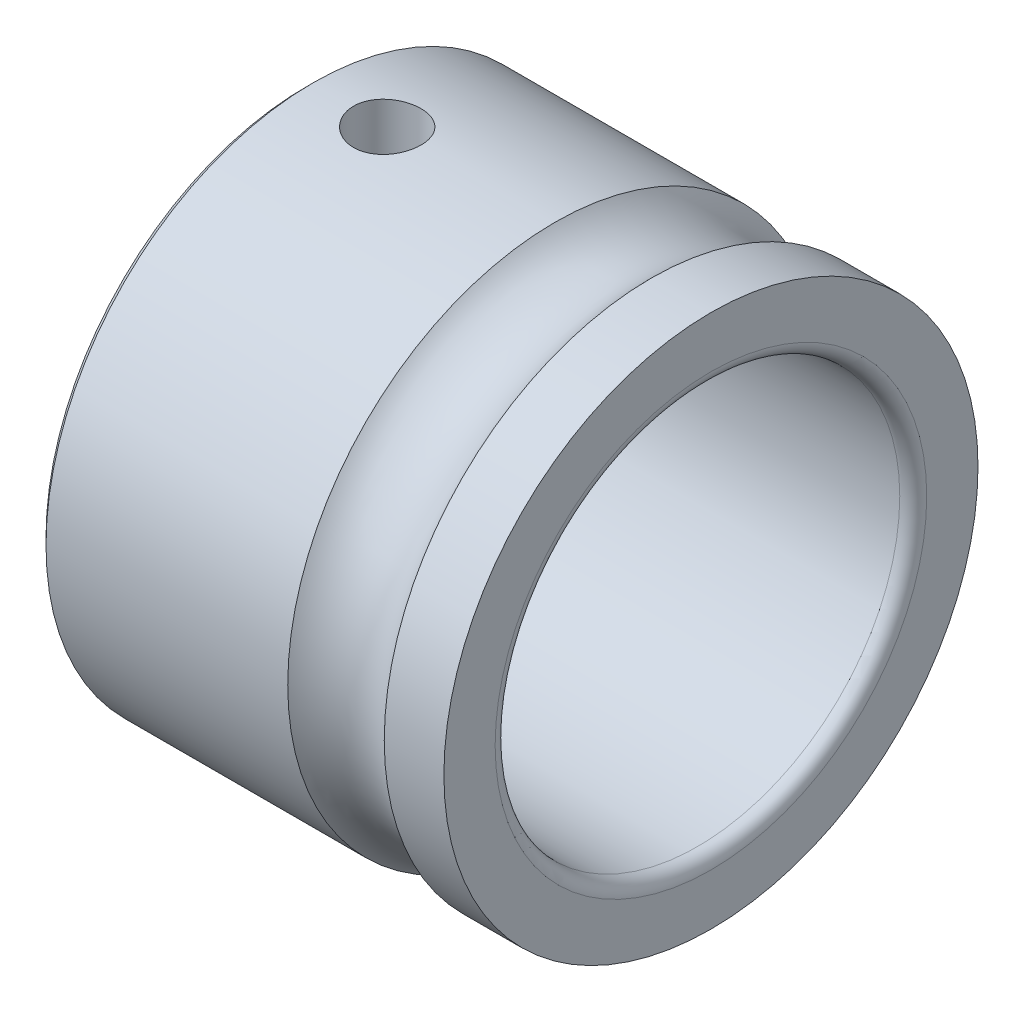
ISO-10303-21;
HEADER;
FILE_DESCRIPTION(('STEP AP214'),'2;1');
FILE_NAME('part.step','',(''),(''),'','','');
FILE_SCHEMA(('AUTOMOTIVE_DESIGN { 1 0 10303 214 1 1 1 1 }'));
ENDSEC;
DATA;
#1=APPLICATION_CONTEXT('core data for automotive mechanical design processes');
#2=APPLICATION_PROTOCOL_DEFINITION('international standard','automotive_design',2000,#1);
#3=PRODUCT_CONTEXT('',#1,'mechanical');
#4=PRODUCT('Part','Part','',(#3));
#5=PRODUCT_RELATED_PRODUCT_CATEGORY('part','',(#4));
#6=PRODUCT_DEFINITION_FORMATION('','',#4);
#7=PRODUCT_DEFINITION_CONTEXT('part definition',#1,'design');
#8=PRODUCT_DEFINITION('design','',#6,#7);
#9=PRODUCT_DEFINITION_SHAPE('','',#8);
#10=(LENGTH_UNIT() NAMED_UNIT(*) SI_UNIT(.MILLI.,.METRE.));
#11=(NAMED_UNIT(*) PLANE_ANGLE_UNIT() SI_UNIT($,.RADIAN.));
#12=(NAMED_UNIT(*) SI_UNIT($,.STERADIAN.) SOLID_ANGLE_UNIT());
#13=UNCERTAINTY_MEASURE_WITH_UNIT(LENGTH_MEASURE(1.E-05),#10,'distance_accuracy_value','');
#14=(GEOMETRIC_REPRESENTATION_CONTEXT(3) GLOBAL_UNCERTAINTY_ASSIGNED_CONTEXT((#13)) GLOBAL_UNIT_ASSIGNED_CONTEXT((#10,
#11,#12)) REPRESENTATION_CONTEXT('',''));
#15=CARTESIAN_POINT('',(0.,0.,0.));
#16=DIRECTION('',(0.,0.,1.));
#17=DIRECTION('',(1.,0.,0.));
#18=AXIS2_PLACEMENT_3D('',#15,#16,#17);
#19=CARTESIAN_POINT('',(0.,0.,0.));
#20=DIRECTION('',(-1.,0.,0.));
#21=DIRECTION('',(0.,0.,1.));
#22=AXIS2_PLACEMENT_3D('',#19,#20,#21);
#23=CYLINDRICAL_SURFACE('',#22,15.);
#24=CARTESIAN_POINT('',(-8.00000000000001,-2.50000000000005,-14.790199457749));
#25=CARTESIAN_POINT('',(-8.13937574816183,-2.49999439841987,-14.790201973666));
#26=CARTESIAN_POINT('',(-8.27882760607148,-2.48830516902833,-14.7921909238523));
#27=CARTESIAN_POINT('',(-8.55381854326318,-2.44187742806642,-14.7999245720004));
#28=CARTESIAN_POINT('',(-8.68935389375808,-2.40711766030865,-14.8056727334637));
#29=CARTESIAN_POINT('',(-8.95249228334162,-2.31562954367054,-14.8202560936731));
#30=CARTESIAN_POINT('',(-9.08010184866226,-2.25891955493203,-14.8290887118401));
#31=CARTESIAN_POINT('',(-9.32398095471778,-2.12518649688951,-14.8488427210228));
#32=CARTESIAN_POINT('',(-9.44025176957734,-2.04816571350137,-14.8597638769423));
#33=CARTESIAN_POINT('',(-9.65931284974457,-1.87518752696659,-14.8825847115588));
#34=CARTESIAN_POINT('',(-9.76197513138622,-1.77906904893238,-14.8944921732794));
#35=CARTESIAN_POINT('',(-9.94979330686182,-1.57097200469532,-14.9178748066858));
#36=CARTESIAN_POINT('',(-10.0349481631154,-1.45899249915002,-14.9293499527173));
#37=CARTESIAN_POINT('',(-10.1858145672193,-1.22152286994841,-14.9506573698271));
#38=CARTESIAN_POINT('',(-10.2514070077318,-1.09595608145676,-14.9604794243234));
#39=CARTESIAN_POINT('',(-10.3605210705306,-0.835395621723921,-14.9772873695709));
#40=CARTESIAN_POINT('',(-10.4040441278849,-0.700402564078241,-14.9842734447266));
#41=CARTESIAN_POINT('',(-10.4673925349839,-0.426143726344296,-14.994567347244));
#42=CARTESIAN_POINT('',(-10.4874329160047,-0.286928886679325,-14.9979085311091));
#43=CARTESIAN_POINT('',(-10.5039157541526,-0.00707528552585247,-15.0006507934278));
#44=CARTESIAN_POINT('',(-10.5003598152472,0.133563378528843,-15.0000521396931));
#45=CARTESIAN_POINT('',(-10.4699186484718,0.410802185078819,-14.9950085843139));
#46=CARTESIAN_POINT('',(-10.4432648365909,0.547428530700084,-14.990601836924));
#47=CARTESIAN_POINT('',(-10.3677489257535,0.814241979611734,-14.9784797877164));
#48=CARTESIAN_POINT('',(-10.3188861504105,0.944428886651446,-14.9707643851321));
#49=CARTESIAN_POINT('',(-10.2001093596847,1.19535614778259,-14.9528269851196));
#50=CARTESIAN_POINT('',(-10.1300999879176,1.31605052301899,-14.9425936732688));
#51=CARTESIAN_POINT('',(-9.97108717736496,1.54406552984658,-14.920757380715));
#52=CARTESIAN_POINT('',(-9.8820822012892,1.65138507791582,-14.9091542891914));
#53=CARTESIAN_POINT('',(-9.68632119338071,1.85097127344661,-14.885702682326));
#54=CARTESIAN_POINT('',(-9.57936290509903,1.94303950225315,-14.8738528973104));
#55=CARTESIAN_POINT('',(-9.35141290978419,2.107954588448,-14.8513795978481));
#56=CARTESIAN_POINT('',(-9.23042107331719,2.18080126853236,-14.8407560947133));
#57=CARTESIAN_POINT('',(-8.97760835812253,2.30524443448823,-14.8219375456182));
#58=CARTESIAN_POINT('',(-8.84577550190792,2.35681702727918,-14.813745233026));
#59=CARTESIAN_POINT('',(-8.57515092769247,2.43702987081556,-14.8007618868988));
#60=CARTESIAN_POINT('',(-8.43635982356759,2.4656721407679,-14.7959705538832));
#61=CARTESIAN_POINT('',(-8.15753384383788,2.49893188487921,-14.7903895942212));
#62=CARTESIAN_POINT('',(-8.01753362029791,2.50383220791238,-14.7895528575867));
#63=CARTESIAN_POINT('',(-7.73871332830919,2.4902227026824,-14.7918503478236));
#64=CARTESIAN_POINT('',(-7.59989321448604,2.47171377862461,-14.7949844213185));
#65=CARTESIAN_POINT('',(-7.32827224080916,2.41205233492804,-14.8048268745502));
#66=CARTESIAN_POINT('',(-7.19543886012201,2.37104379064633,-14.8115125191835));
#67=CARTESIAN_POINT('',(-6.93852983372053,2.26769819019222,-14.827685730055));
#68=CARTESIAN_POINT('',(-6.81445471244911,2.20535985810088,-14.8371734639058));
#69=CARTESIAN_POINT('',(-6.57732540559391,2.06045667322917,-14.8579912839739));
#70=CARTESIAN_POINT('',(-6.46438342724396,1.97771056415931,-14.8693375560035));
#71=CARTESIAN_POINT('',(-6.25388646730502,1.79458946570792,-14.8925466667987));
#72=CARTESIAN_POINT('',(-6.15633256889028,1.69421323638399,-14.9044095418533));
#73=CARTESIAN_POINT('',(-5.97834810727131,1.47742807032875,-14.9274642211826));
#74=CARTESIAN_POINT('',(-5.89810617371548,1.36086325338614,-14.9386477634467));
#75=CARTESIAN_POINT('',(-5.75834467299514,1.11574344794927,-14.9589511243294));
#76=CARTESIAN_POINT('',(-5.69882443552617,0.987188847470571,-14.9680710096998));
#77=CARTESIAN_POINT('',(-5.60248941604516,0.722299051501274,-14.9831835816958));
#78=CARTESIAN_POINT('',(-5.5655759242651,0.586000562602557,-14.9891898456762));
#79=CARTESIAN_POINT('',(-5.51518440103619,0.309030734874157,-14.9974558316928));
#80=CARTESIAN_POINT('',(-5.50170444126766,0.168359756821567,-14.9997158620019));
#81=CARTESIAN_POINT('',(-5.49861811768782,-0.111541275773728,-15.0002303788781));
#82=CARTESIAN_POINT('',(-5.50872474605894,-0.250768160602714,-14.9985330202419));
#83=CARTESIAN_POINT('',(-5.55190392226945,-0.525511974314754,-14.9914217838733));
#84=CARTESIAN_POINT('',(-5.58497634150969,-0.661028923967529,-14.9860079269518));
#85=CARTESIAN_POINT('',(-5.67303816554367,-0.924396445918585,-14.972069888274));
#86=CARTESIAN_POINT('',(-5.72800316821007,-1.05225537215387,-14.9635491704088));
#87=CARTESIAN_POINT('',(-5.8582579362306,-1.29698045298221,-14.9443275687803));
#88=CARTESIAN_POINT('',(-5.93354866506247,-1.41384608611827,-14.9336265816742));
#89=CARTESIAN_POINT('',(-6.10333509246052,-1.63471294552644,-14.9110762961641));
#90=CARTESIAN_POINT('',(-6.19804095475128,-1.73855143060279,-14.8992152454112));
#91=CARTESIAN_POINT('',(-6.40352830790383,-1.92896387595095,-14.8757630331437));
#92=CARTESIAN_POINT('',(-6.51431355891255,-2.01553378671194,-14.8641719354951));
#93=CARTESIAN_POINT('',(-6.74974532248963,-2.16951427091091,-14.8424834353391));
#94=CARTESIAN_POINT('',(-6.8744843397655,-2.23678498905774,-14.8323971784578));
#95=CARTESIAN_POINT('',(-7.13360923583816,-2.34931453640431,-14.8149921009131));
#96=CARTESIAN_POINT('',(-7.26798532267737,-2.39459535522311,-14.8076705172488));
#97=CARTESIAN_POINT('',(-7.50240376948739,-2.45202605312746,-14.7982474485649));
#98=CARTESIAN_POINT('',(-7.60102680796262,-2.46998741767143,-14.7952462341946));
#99=CARTESIAN_POINT('',(-7.79975348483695,-2.49397629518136,-14.7912213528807));
#100=CARTESIAN_POINT('',(-7.89985709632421,-2.50000402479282,-14.7901976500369));
#101=CARTESIAN_POINT('',(-8.00000000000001,-2.50000000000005,-14.790199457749));
#102=B_SPLINE_CURVE_WITH_KNOTS('',3,(#24,#25,#26,#27,#28,#29,#30,#31,#32,#33,#34,#35,#36,#37,
#38,#39,#40,#41,#42,#43,#44,#45,#46,#47,#48,#49,#50,#51,#52,#53,#54,#55,#56,#57,#58,#59,#60,#61,
#62,#63,#64,#65,#66,#67,#68,#69,#70,#71,#72,#73,#74,#75,#76,#77,#78,#79,#80,#81,#82,#83,#84,#85,
#86,#87,#88,#89,#90,#91,#92,#93,#94,#95,#96,#97,#98,#99,#100,#101),.UNSPECIFIED.,.T.,.F.,(4,2,2,
2,2,2,2,2,2,2,2,2,2,2,2,2,2,2,2,2,2,2,2,2,2,2,2,2,2,2,2,2,2,2,2,2,2,2,4),(0.,0.417761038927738,
0.835907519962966,1.25370499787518,1.67145547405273,2.09289159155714,2.51435267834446,
2.93832980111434,3.36227935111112,3.78231567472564,4.2023234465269,4.61817121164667,
5.03403164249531,5.45179604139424,5.86959426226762,6.29246123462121,6.71533210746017,
7.13867662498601,7.56198385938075,7.98023542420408,8.39847083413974,8.81406064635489,
9.22967532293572,9.64912342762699,10.0686010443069,10.4924411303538,10.916267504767,
11.3382298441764,11.7601574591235,12.1769777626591,12.5937957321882,13.0101503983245,
13.4265248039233,13.8476699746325,14.2689137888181,14.6931372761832,15.1169356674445,
15.4171067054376,15.7172722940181),.UNSPECIFIED.);
#103=CARTESIAN_POINT('',(-8.00000000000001,-2.50000000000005,-14.790199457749));
#104=VERTEX_POINT('',#103);
#105=EDGE_CURVE('E84',#104,#104,#102,.T.);
#106=ORIENTED_EDGE('',*,*,#105,.T.);
#107=EDGE_LOOP('',(#106));
#108=FACE_BOUND('',#107,.T.);
#109=CARTESIAN_POINT('',(-8.00000000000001,14.7901994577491,-2.49999999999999));
#110=CARTESIAN_POINT('',(-8.13937574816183,14.7902019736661,-2.49999439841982));
#111=CARTESIAN_POINT('',(-8.27882760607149,14.7921909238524,-2.48830516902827));
#112=CARTESIAN_POINT('',(-8.55381854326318,14.7999245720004,-2.44187742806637));
#113=CARTESIAN_POINT('',(-8.68935389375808,14.8056727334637,-2.4071176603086));
#114=CARTESIAN_POINT('',(-8.95249228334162,14.8202560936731,-2.31562954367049));
#115=CARTESIAN_POINT('',(-9.08010184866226,14.8290887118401,-2.25891955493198));
#116=CARTESIAN_POINT('',(-9.32398095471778,14.8488427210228,-2.12518649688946));
#117=CARTESIAN_POINT('',(-9.44025176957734,14.8597638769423,-2.04816571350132));
#118=CARTESIAN_POINT('',(-9.65931284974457,14.8825847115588,-1.87518752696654));
#119=CARTESIAN_POINT('',(-9.76197513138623,14.8944921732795,-1.77906904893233));
#120=CARTESIAN_POINT('',(-9.94979330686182,14.9178748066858,-1.57097200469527));
#121=CARTESIAN_POINT('',(-10.0349481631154,14.9293499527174,-1.45899249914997));
#122=CARTESIAN_POINT('',(-10.1858145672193,14.9506573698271,-1.22152286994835));
#123=CARTESIAN_POINT('',(-10.2514070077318,14.9604794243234,-1.0959560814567));
#124=CARTESIAN_POINT('',(-10.3605210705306,14.9772873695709,-0.835395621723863));
#125=CARTESIAN_POINT('',(-10.4040441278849,14.9842734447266,-0.700402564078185));
#126=CARTESIAN_POINT('',(-10.4673925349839,14.994567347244,-0.426143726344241));
#127=CARTESIAN_POINT('',(-10.4874329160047,14.9979085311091,-0.28692888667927));
#128=CARTESIAN_POINT('',(-10.5039157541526,15.0006507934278,-0.00707528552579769));
#129=CARTESIAN_POINT('',(-10.5003598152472,15.0000521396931,0.133563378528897));
#130=CARTESIAN_POINT('',(-10.4699186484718,14.9950085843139,0.410802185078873));
#131=CARTESIAN_POINT('',(-10.4432648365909,14.990601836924,0.547428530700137));
#132=CARTESIAN_POINT('',(-10.3677489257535,14.9784797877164,0.814241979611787));
#133=CARTESIAN_POINT('',(-10.3188861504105,14.9707643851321,0.944428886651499));
#134=CARTESIAN_POINT('',(-10.2001093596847,14.9528269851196,1.19535614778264));
#135=CARTESIAN_POINT('',(-10.1300999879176,14.9425936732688,1.31605052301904));
#136=CARTESIAN_POINT('',(-9.97108717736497,14.920757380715,1.54406552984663));
#137=CARTESIAN_POINT('',(-9.8820822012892,14.9091542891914,1.65138507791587));
#138=CARTESIAN_POINT('',(-9.68632119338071,14.885702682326,1.85097127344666));
#139=CARTESIAN_POINT('',(-9.57936290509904,14.8738528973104,1.9430395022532));
#140=CARTESIAN_POINT('',(-9.3514129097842,14.8513795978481,2.10795458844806));
#141=CARTESIAN_POINT('',(-9.2304210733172,14.8407560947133,2.18080126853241));
#142=CARTESIAN_POINT('',(-8.97760835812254,14.8219375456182,2.30524443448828));
#143=CARTESIAN_POINT('',(-8.84577550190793,14.813745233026,2.35681702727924));
#144=CARTESIAN_POINT('',(-8.57515092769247,14.8007618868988,2.43702987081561));
#145=CARTESIAN_POINT('',(-8.43635982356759,14.7959705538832,2.46567214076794));
#146=CARTESIAN_POINT('',(-8.15753384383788,14.7903895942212,2.49893188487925));
#147=CARTESIAN_POINT('',(-8.01753362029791,14.7895528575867,2.50383220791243));
#148=CARTESIAN_POINT('',(-7.7387133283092,14.7918503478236,2.49022270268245));
#149=CARTESIAN_POINT('',(-7.59989321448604,14.7949844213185,2.47171377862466));
#150=CARTESIAN_POINT('',(-7.32827224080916,14.8048268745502,2.41205233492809));
#151=CARTESIAN_POINT('',(-7.19543886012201,14.8115125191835,2.37104379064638));
#152=CARTESIAN_POINT('',(-6.93852983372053,14.827685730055,2.26769819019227));
#153=CARTESIAN_POINT('',(-6.81445471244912,14.8371734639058,2.20535985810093));
#154=CARTESIAN_POINT('',(-6.57732540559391,14.8579912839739,2.06045667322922));
#155=CARTESIAN_POINT('',(-6.46438342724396,14.8693375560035,1.97771056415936));
#156=CARTESIAN_POINT('',(-6.25388646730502,14.8925466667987,1.79458946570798));
#157=CARTESIAN_POINT('',(-6.15633256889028,14.9044095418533,1.69421323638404));
#158=CARTESIAN_POINT('',(-5.97834810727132,14.9274642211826,1.47742807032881));
#159=CARTESIAN_POINT('',(-5.89810617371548,14.9386477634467,1.36086325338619));
#160=CARTESIAN_POINT('',(-5.75834467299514,14.9589511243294,1.11574344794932));
#161=CARTESIAN_POINT('',(-5.69882443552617,14.9680710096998,0.987188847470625));
#162=CARTESIAN_POINT('',(-5.60248941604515,14.9831835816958,0.722299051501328));
#163=CARTESIAN_POINT('',(-5.5655759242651,14.9891898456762,0.58600056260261));
#164=CARTESIAN_POINT('',(-5.5151844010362,14.9974558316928,0.309030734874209));
#165=CARTESIAN_POINT('',(-5.50170444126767,14.9997158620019,0.168359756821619));
#166=CARTESIAN_POINT('',(-5.49861811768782,15.0002303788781,-0.111541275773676));
#167=CARTESIAN_POINT('',(-5.50872474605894,14.9985330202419,-0.250768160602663));
#168=CARTESIAN_POINT('',(-5.55190392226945,14.9914217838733,-0.525511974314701));
#169=CARTESIAN_POINT('',(-5.58497634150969,14.9860079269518,-0.661028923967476));
#170=CARTESIAN_POINT('',(-5.67303816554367,14.972069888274,-0.924396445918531));
#171=CARTESIAN_POINT('',(-5.72800316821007,14.9635491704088,-1.05225537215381));
#172=CARTESIAN_POINT('',(-5.8582579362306,14.9443275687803,-1.29698045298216));
#173=CARTESIAN_POINT('',(-5.93354866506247,14.9336265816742,-1.41384608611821));
#174=CARTESIAN_POINT('',(-6.10333509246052,14.9110762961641,-1.63471294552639));
#175=CARTESIAN_POINT('',(-6.19804095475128,14.8992152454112,-1.73855143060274));
#176=CARTESIAN_POINT('',(-6.40352830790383,14.8757630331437,-1.9289638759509));
#177=CARTESIAN_POINT('',(-6.51431355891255,14.8641719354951,-2.01553378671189));
#178=CARTESIAN_POINT('',(-6.74974532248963,14.8424834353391,-2.16951427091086));
#179=CARTESIAN_POINT('',(-6.8744843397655,14.8323971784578,-2.23678498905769));
#180=CARTESIAN_POINT('',(-7.13360923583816,14.8149921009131,-2.34931453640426));
#181=CARTESIAN_POINT('',(-7.26798532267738,14.8076705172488,-2.39459535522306));
#182=CARTESIAN_POINT('',(-7.5024037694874,14.7982474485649,-2.45202605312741));
#183=CARTESIAN_POINT('',(-7.60102680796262,14.7952462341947,-2.46998741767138));
#184=CARTESIAN_POINT('',(-7.79975348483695,14.7912213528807,-2.4939762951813));
#185=CARTESIAN_POINT('',(-7.89985709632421,14.7901976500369,-2.50000402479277));
#186=CARTESIAN_POINT('',(-8.00000000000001,14.7901994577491,-2.49999999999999));
#187=B_SPLINE_CURVE_WITH_KNOTS('',3,(#109,#110,#111,#112,#113,#114,#115,#116,#117,#118,#119,
#120,#121,#122,#123,#124,#125,#126,#127,#128,#129,#130,#131,#132,#133,#134,#135,#136,#137,#138,
#139,#140,#141,#142,#143,#144,#145,#146,#147,#148,#149,#150,#151,#152,#153,#154,#155,#156,#157,
#158,#159,#160,#161,#162,#163,#164,#165,#166,#167,#168,#169,#170,#171,#172,#173,#174,#175,#176,
#177,#178,#179,#180,#181,#182,#183,#184,#185,#186),.UNSPECIFIED.,.T.,.F.,(4,2,2,2,2,2,2,2,2,2,2,
2,2,2,2,2,2,2,2,2,2,2,2,2,2,2,2,2,2,2,2,2,2,2,2,2,2,2,4),(0.,0.41776103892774,0.835907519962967,
1.25370499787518,1.67145547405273,2.09289159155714,2.51435267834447,2.93832980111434,
3.36227935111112,3.78231567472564,4.20232344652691,4.61817121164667,5.03403164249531,
5.45179604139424,5.86959426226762,6.29246123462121,6.71533210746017,7.13867662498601,
7.56198385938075,7.98023542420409,8.39847083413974,8.81406064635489,9.22967532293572,
9.64912342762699,10.0686010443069,10.4924411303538,10.916267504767,11.3382298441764,
11.7601574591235,12.1769777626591,12.5937957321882,13.0101503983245,13.4265248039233,
13.8476699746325,14.2689137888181,14.6931372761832,15.1169356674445,15.4171067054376,
15.7172722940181),.UNSPECIFIED.);
#188=CARTESIAN_POINT('',(-8.00000000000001,14.7901994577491,-2.49999999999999));
#189=VERTEX_POINT('',#188);
#190=EDGE_CURVE('E79',#189,#189,#187,.T.);
#191=ORIENTED_EDGE('',*,*,#190,.T.);
#192=EDGE_LOOP('',(#191));
#193=FACE_BOUND('',#192,.T.);
#194=CARTESIAN_POINT('',(-13.,0.,0.));
#195=DIRECTION('',(-1.,0.,0.));
#196=DIRECTION('',(0.,0.,1.));
#197=AXIS2_PLACEMENT_3D('',#194,#195,#196);
#198=CIRCLE('',#197,15.);
#199=CARTESIAN_POINT('',(-13.,0.,15.));
#200=VERTEX_POINT('',#199);
#201=EDGE_CURVE('E61',#200,#200,#198,.T.);
#202=ORIENTED_EDGE('',*,*,#201,.T.);
#203=EDGE_LOOP('',(#202));
#204=FACE_BOUND('',#203,.T.);
#205=CARTESIAN_POINT('',(15.,0.,0.));
#206=DIRECTION('',(-1.,0.,0.));
#207=DIRECTION('',(0.,0.,1.));
#208=AXIS2_PLACEMENT_3D('',#205,#206,#207);
#209=CIRCLE('',#208,15.);
#210=CARTESIAN_POINT('',(15.,0.,15.));
#211=VERTEX_POINT('',#210);
#212=EDGE_CURVE('E64',#211,#211,#209,.T.);
#213=ORIENTED_EDGE('',*,*,#212,.F.);
#214=EDGE_LOOP('',(#213));
#215=FACE_BOUND('',#214,.T.);
#216=ADVANCED_FACE('F36',(#108,#193,#204,#215),#23,.F.);
#217=CARTESIAN_POINT('',(15.,0.,0.));
#218=DIRECTION('',(-1.,0.,0.));
#219=DIRECTION('',(0.,0.,1.));
#220=AXIS2_PLACEMENT_3D('',#217,#218,#219);
#221=TOROIDAL_SURFACE('',#220,16.,0.999999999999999);
#222=CARTESIAN_POINT('',(16.,0.,0.));
#223=DIRECTION('',(-1.,0.,0.));
#224=DIRECTION('',(0.,0.,1.));
#225=AXIS2_PLACEMENT_3D('',#222,#223,#224);
#226=CIRCLE('',#225,16.);
#227=CARTESIAN_POINT('',(16.,0.,16.));
#228=VERTEX_POINT('',#227);
#229=EDGE_CURVE('E67',#228,#228,#226,.T.);
#230=ORIENTED_EDGE('',*,*,#229,.F.);
#231=EDGE_LOOP('',(#230));
#232=FACE_BOUND('',#231,.T.);
#233=ORIENTED_EDGE('',*,*,#212,.T.);
#234=EDGE_LOOP('',(#233));
#235=FACE_BOUND('',#234,.T.);
#236=ADVANCED_FACE('F125',(#232,#235),#221,.T.);
#237=CARTESIAN_POINT('',(16.,0.,-19.8));
#238=DIRECTION('',(-1.,0.,0.));
#239=DIRECTION('',(0.,0.,1.));
#240=AXIS2_PLACEMENT_3D('',#237,#238,#239);
#241=PLANE('',#240);
#242=CARTESIAN_POINT('',(16.,0.,0.));
#243=DIRECTION('',(-1.,0.,0.));
#244=DIRECTION('',(0.,0.,1.));
#245=AXIS2_PLACEMENT_3D('',#242,#243,#244);
#246=CIRCLE('',#245,19.8);
#247=CARTESIAN_POINT('',(16.,0.,19.8));
#248=VERTEX_POINT('',#247);
#249=EDGE_CURVE('E70',#248,#248,#246,.T.);
#250=ORIENTED_EDGE('',*,*,#249,.F.);
#251=EDGE_LOOP('',(#250));
#252=FACE_BOUND('',#251,.T.);
#253=ORIENTED_EDGE('',*,*,#229,.T.);
#254=EDGE_LOOP('',(#253));
#255=FACE_BOUND('',#254,.T.);
#256=ADVANCED_FACE('F122',(#252,#255),#241,.F.);
#257=CARTESIAN_POINT('',(0.,0.,0.));
#258=DIRECTION('',(-1.,0.,0.));
#259=DIRECTION('',(0.,0.,1.));
#260=AXIS2_PLACEMENT_3D('',#257,#258,#259);
#261=CYLINDRICAL_SURFACE('',#260,19.8);
#262=CARTESIAN_POINT('',(11.5777087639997,0.,0.));
#263=DIRECTION('',(-1.,0.,0.));
#264=DIRECTION('',(0.,0.,1.));
#265=AXIS2_PLACEMENT_3D('',#262,#263,#264);
#266=CIRCLE('',#265,19.8);
#267=CARTESIAN_POINT('',(11.5777087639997,0.,19.8));
#268=VERTEX_POINT('',#267);
#269=EDGE_CURVE('E73',#268,#268,#266,.T.);
#270=ORIENTED_EDGE('',*,*,#269,.F.);
#271=EDGE_LOOP('',(#270));
#272=FACE_BOUND('',#271,.T.);
#273=ORIENTED_EDGE('',*,*,#249,.T.);
#274=EDGE_LOOP('',(#273));
#275=FACE_BOUND('',#274,.T.);
#276=ADVANCED_FACE('F118',(#272,#275),#261,.T.);
#277=CARTESIAN_POINT('',(8.00000000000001,0.,0.));
#278=DIRECTION('',(-1.,0.,0.));
#279=DIRECTION('',(0.,0.,1.));
#280=AXIS2_PLACEMENT_3D('',#277,#278,#279);
#281=TOROIDAL_SURFACE('',#280,23.,4.8);
#282=CARTESIAN_POINT('',(4.42229123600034,0.,0.));
#283=DIRECTION('',(-1.,0.,0.));
#284=DIRECTION('',(0.,0.,1.));
#285=AXIS2_PLACEMENT_3D('',#282,#283,#284);
#286=CIRCLE('',#285,19.8);
#287=CARTESIAN_POINT('',(4.42229123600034,0.,19.8));
#288=VERTEX_POINT('',#287);
#289=EDGE_CURVE('E76',#288,#288,#286,.T.);
#290=ORIENTED_EDGE('',*,*,#289,.F.);
#291=EDGE_LOOP('',(#290));
#292=FACE_BOUND('',#291,.T.);
#293=ORIENTED_EDGE('',*,*,#269,.T.);
#294=EDGE_LOOP('',(#293));
#295=FACE_BOUND('',#294,.T.);
#296=ADVANCED_FACE('F114',(#292,#295),#281,.F.);
#297=CARTESIAN_POINT('',(0.,0.,0.));
#298=DIRECTION('',(-1.,0.,0.));
#299=DIRECTION('',(0.,0.,1.));
#300=AXIS2_PLACEMENT_3D('',#297,#298,#299);
#301=CYLINDRICAL_SURFACE('',#300,19.8);
#302=CARTESIAN_POINT('',(-10.5,0.,-19.8));
#303=CARTESIAN_POINT('',(-10.4999940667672,-0.139829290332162,-19.7999980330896));
#304=CARTESIAN_POINT('',(-10.4882291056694,-0.279745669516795,-19.7985031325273));
#305=CARTESIAN_POINT('',(-10.4414825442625,-0.555684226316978,-19.7926834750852));
#306=CARTESIAN_POINT('',(-10.4064767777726,-0.69170219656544,-19.7883557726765));
#307=CARTESIAN_POINT('',(-10.3142970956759,-0.955809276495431,-19.7773579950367));
#308=CARTESIAN_POINT('',(-10.2571381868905,-1.08390368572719,-19.7706895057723));
#309=CARTESIAN_POINT('',(-10.1223077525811,-1.32865787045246,-19.7557516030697));
#310=CARTESIAN_POINT('',(-10.0446397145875,-1.44531958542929,-19.7474824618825));
#311=CARTESIAN_POINT('',(-9.87052979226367,-1.66457562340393,-19.7302144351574));
#312=CARTESIAN_POINT('',(-9.77399579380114,-1.76709653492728,-19.7212121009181));
#313=CARTESIAN_POINT('',(-9.5650919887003,-1.95452848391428,-19.7035200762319));
#314=CARTESIAN_POINT('',(-9.45272137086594,-2.03943861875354,-19.6948304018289));
#315=CARTESIAN_POINT('',(-9.21485630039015,-2.18951273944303,-19.6787136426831));
#316=CARTESIAN_POINT('',(-9.08931806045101,-2.25460784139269,-19.6712910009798));
#317=CARTESIAN_POINT('',(-8.82898218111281,-2.36276415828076,-19.658594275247));
#318=CARTESIAN_POINT('',(-8.69418490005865,-2.40582622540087,-19.6533201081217));
#319=CARTESIAN_POINT('',(-8.41991973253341,-2.46847079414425,-19.6455504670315));
#320=CARTESIAN_POINT('',(-8.28048060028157,-2.48817733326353,-19.6430403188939));
#321=CARTESIAN_POINT('',(-8.00025346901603,-2.50393528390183,-19.6410380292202));
#322=CARTESIAN_POINT('',(-7.8594655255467,-2.49998766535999,-19.6415457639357));
#323=CARTESIAN_POINT('',(-7.58140221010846,-2.46865115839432,-19.6455084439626));
#324=CARTESIAN_POINT('',(-7.44411115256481,-2.44139897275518,-19.6489462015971));
#325=CARTESIAN_POINT('',(-7.17606660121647,-2.36444024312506,-19.6583547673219));
#326=CARTESIAN_POINT('',(-7.04531324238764,-2.31473323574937,-19.664325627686));
#327=CARTESIAN_POINT('',(-6.79363142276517,-2.19412914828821,-19.6781470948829));
#328=CARTESIAN_POINT('',(-6.67273169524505,-2.12317273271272,-19.6860029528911));
#329=CARTESIAN_POINT('',(-6.4445039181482,-1.96212645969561,-19.7027052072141));
#330=CARTESIAN_POINT('',(-6.33717650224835,-1.87203570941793,-19.711551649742));
#331=CARTESIAN_POINT('',(-6.13834656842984,-1.67452083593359,-19.729314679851));
#332=CARTESIAN_POINT('',(-6.04696105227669,-1.56697889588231,-19.7382313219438));
#333=CARTESIAN_POINT('',(-5.88352025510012,-1.33801983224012,-19.7550716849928));
#334=CARTESIAN_POINT('',(-5.81146502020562,-1.21660267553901,-19.7629954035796));
#335=CARTESIAN_POINT('',(-5.68872980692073,-0.963249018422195,-19.776962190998));
#336=CARTESIAN_POINT('',(-5.63805723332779,-0.831308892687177,-19.783004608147));
#337=CARTESIAN_POINT('',(-5.55961904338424,-0.560699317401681,-19.7925220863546));
#338=CARTESIAN_POINT('',(-5.5318523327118,-0.422030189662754,-19.7959972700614));
#339=CARTESIAN_POINT('',(-5.50016588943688,-0.142910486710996,-19.7999727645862));
#340=CARTESIAN_POINT('',(-5.49608499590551,-0.00247848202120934,-19.80049317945));
#341=CARTESIAN_POINT('',(-5.51146060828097,0.277067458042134,-19.7985548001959));
#342=CARTESIAN_POINT('',(-5.53091660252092,0.416181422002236,-19.7960960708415));
#343=CARTESIAN_POINT('',(-5.59267981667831,0.688666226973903,-19.788488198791));
#344=CARTESIAN_POINT('',(-5.63491011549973,0.822054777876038,-19.7833481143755));
#345=CARTESIAN_POINT('',(-5.74094314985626,1.07985662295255,-19.7709529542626));
#346=CARTESIAN_POINT('',(-5.80474663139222,1.20426960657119,-19.7636978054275));
#347=CARTESIAN_POINT('',(-5.95250425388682,1.44130792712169,-19.7478311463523));
#348=CARTESIAN_POINT('',(-6.03656255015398,1.55386786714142,-19.7392127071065));
#349=CARTESIAN_POINT('',(-6.22229645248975,1.76333939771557,-19.721605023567));
#350=CARTESIAN_POINT('',(-6.3239727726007,1.86025035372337,-19.7126157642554));
#351=CARTESIAN_POINT('',(-6.54276676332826,2.03624544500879,-19.6952174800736));
#352=CARTESIAN_POINT('',(-6.65997074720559,2.11522269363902,-19.6868121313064));
#353=CARTESIAN_POINT('',(-6.9060746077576,2.25236986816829,-19.6715940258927));
#354=CARTESIAN_POINT('',(-7.03497424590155,2.31054021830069,-19.6647812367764));
#355=CARTESIAN_POINT('',(-7.30046676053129,2.40424965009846,-19.6535447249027));
#356=CARTESIAN_POINT('',(-7.43703815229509,2.43984880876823,-19.6491146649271));
#357=CARTESIAN_POINT('',(-7.71427987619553,2.48759869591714,-19.6431270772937));
#358=CARTESIAN_POINT('',(-7.85495001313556,2.49975053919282,-19.6415694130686));
#359=CARTESIAN_POINT('',(-8.13533264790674,2.50024011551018,-19.641507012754));
#360=CARTESIAN_POINT('',(-8.27504487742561,2.4887457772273,-19.6429807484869));
#361=CARTESIAN_POINT('',(-8.55053461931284,2.44262507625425,-19.6487687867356));
#362=CARTESIAN_POINT('',(-8.68631213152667,2.40799871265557,-19.653083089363));
#363=CARTESIAN_POINT('',(-8.95005497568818,2.31664970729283,-19.6640594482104));
#364=CARTESIAN_POINT('',(-9.0780232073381,2.25993532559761,-19.6707206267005));
#365=CARTESIAN_POINT('',(-9.32265361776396,2.12603671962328,-19.6856416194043));
#366=CARTESIAN_POINT('',(-9.43931564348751,2.04885221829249,-19.6939014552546));
#367=CARTESIAN_POINT('',(-9.65888022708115,1.87558191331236,-19.7111593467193));
#368=CARTESIAN_POINT('',(-9.76168368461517,1.77937098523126,-19.7201620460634));
#369=CARTESIAN_POINT('',(-9.94975072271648,1.57104012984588,-19.7378503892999));
#370=CARTESIAN_POINT('',(-10.0350101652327,1.45891645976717,-19.7465359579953));
#371=CARTESIAN_POINT('',(-10.1858512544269,1.22144344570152,-19.7626486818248));
#372=CARTESIAN_POINT('',(-10.2513553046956,1.09604449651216,-19.7700708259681));
#373=CARTESIAN_POINT('',(-10.3602817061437,0.836002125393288,-19.7827697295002));
#374=CARTESIAN_POINT('',(-10.40372799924,0.701368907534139,-19.7880488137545));
#375=CARTESIAN_POINT('',(-10.4569310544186,0.471702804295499,-19.7945973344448));
#376=CARTESIAN_POINT('',(-10.4730586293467,0.378116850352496,-19.7966134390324));
#377=CARTESIAN_POINT('',(-10.4945950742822,0.189700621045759,-19.799315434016));
#378=CARTESIAN_POINT('',(-10.5000040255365,0.0948703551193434,-19.800001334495));
#379=CARTESIAN_POINT('',(-10.5,0.,-19.8));
#380=B_SPLINE_CURVE_WITH_KNOTS('',3,(#302,#303,#304,#305,#306,#307,#308,#309,#310,#311,#312,
#313,#314,#315,#316,#317,#318,#319,#320,#321,#322,#323,#324,#325,#326,#327,#328,#329,#330,#331,
#332,#333,#334,#335,#336,#337,#338,#339,#340,#341,#342,#343,#344,#345,#346,#347,#348,#349,#350,
#351,#352,#353,#354,#355,#356,#357,#358,#359,#360,#361,#362,#363,#364,#365,#366,#367,#368,#369,
#370,#371,#372,#373,#374,#375,#376,#377,#378,#379),.UNSPECIFIED.,.T.,.F.,(4,2,2,2,2,2,2,2,2,2,2,
2,2,2,2,2,2,2,2,2,2,2,2,2,2,2,2,2,2,2,2,2,2,2,2,2,2,2,4),(0.,0.419141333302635,
0.838719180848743,1.258013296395,1.67723615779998,2.09855948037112,2.51990439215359,
2.94269774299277,3.36547474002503,3.78599622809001,4.20650047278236,4.62455486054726,
5.04261787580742,5.46185932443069,5.8811203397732,6.30333960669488,6.72555988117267,
7.14792625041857,7.57027244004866,7.98974153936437,8.40920152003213,8.82725355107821,
9.24532003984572,9.66558401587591,10.0858650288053,10.5085887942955,10.931303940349,
11.3528891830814,11.7744543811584,12.1930360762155,12.6116177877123,13.0300431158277,
13.4484741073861,13.8697542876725,14.2911337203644,14.7141473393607,15.1367008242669,
15.4210789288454,15.7054548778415),.UNSPECIFIED.);
#381=CARTESIAN_POINT('',(-10.5,0.,-19.8));
#382=VERTEX_POINT('',#381);
#383=EDGE_CURVE('E149',#382,#382,#380,.T.);
#384=ORIENTED_EDGE('',*,*,#383,.T.);
#385=EDGE_LOOP('',(#384));
#386=FACE_BOUND('',#385,.T.);
#387=CARTESIAN_POINT('',(-10.5,19.8,0.));
#388=CARTESIAN_POINT('',(-10.4999940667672,19.7999980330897,-0.139829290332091));
#389=CARTESIAN_POINT('',(-10.4882291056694,19.7985031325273,-0.279745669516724));
#390=CARTESIAN_POINT('',(-10.4414825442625,19.7926834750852,-0.555684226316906));
#391=CARTESIAN_POINT('',(-10.4064767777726,19.7883557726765,-0.691702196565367));
#392=CARTESIAN_POINT('',(-10.3142970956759,19.7773579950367,-0.955809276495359));
#393=CARTESIAN_POINT('',(-10.2571381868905,19.7706895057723,-1.08390368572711));
#394=CARTESIAN_POINT('',(-10.1223077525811,19.7557516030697,-1.32865787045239));
#395=CARTESIAN_POINT('',(-10.0446397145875,19.7474824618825,-1.44531958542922));
#396=CARTESIAN_POINT('',(-9.87052979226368,19.7302144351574,-1.66457562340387));
#397=CARTESIAN_POINT('',(-9.77399579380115,19.7212121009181,-1.76709653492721));
#398=CARTESIAN_POINT('',(-9.5650919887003,19.7035200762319,-1.95452848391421));
#399=CARTESIAN_POINT('',(-9.45272137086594,19.694830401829,-2.03943861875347));
#400=CARTESIAN_POINT('',(-9.21485630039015,19.6787136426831,-2.18951273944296));
#401=CARTESIAN_POINT('',(-9.08931806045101,19.6712910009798,-2.25460784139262));
#402=CARTESIAN_POINT('',(-8.82898218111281,19.658594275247,-2.36276415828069));
#403=CARTESIAN_POINT('',(-8.69418490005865,19.6533201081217,-2.4058262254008));
#404=CARTESIAN_POINT('',(-8.41991973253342,19.6455504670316,-2.46847079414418));
#405=CARTESIAN_POINT('',(-8.28048060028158,19.6430403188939,-2.48817733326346));
#406=CARTESIAN_POINT('',(-8.00025346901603,19.6410380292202,-2.50393528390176));
#407=CARTESIAN_POINT('',(-7.8594655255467,19.6415457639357,-2.49998766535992));
#408=CARTESIAN_POINT('',(-7.58140221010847,19.6455084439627,-2.46865115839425));
#409=CARTESIAN_POINT('',(-7.44411115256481,19.6489462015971,-2.4413989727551));
#410=CARTESIAN_POINT('',(-7.17606660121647,19.6583547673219,-2.36444024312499));
#411=CARTESIAN_POINT('',(-7.04531324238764,19.664325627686,-2.31473323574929));
#412=CARTESIAN_POINT('',(-6.79363142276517,19.6781470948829,-2.19412914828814));
#413=CARTESIAN_POINT('',(-6.67273169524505,19.6860029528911,-2.12317273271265));
#414=CARTESIAN_POINT('',(-6.4445039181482,19.7027052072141,-1.96212645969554));
#415=CARTESIAN_POINT('',(-6.33717650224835,19.711551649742,-1.87203570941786));
#416=CARTESIAN_POINT('',(-6.13834656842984,19.7293146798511,-1.67452083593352));
#417=CARTESIAN_POINT('',(-6.04696105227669,19.7382313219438,-1.56697889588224));
#418=CARTESIAN_POINT('',(-5.88352025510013,19.7550716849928,-1.33801983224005));
#419=CARTESIAN_POINT('',(-5.81146502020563,19.7629954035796,-1.21660267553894));
#420=CARTESIAN_POINT('',(-5.68872980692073,19.776962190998,-0.963249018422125));
#421=CARTESIAN_POINT('',(-5.63805723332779,19.783004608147,-0.831308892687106));
#422=CARTESIAN_POINT('',(-5.55961904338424,19.7925220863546,-0.560699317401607));
#423=CARTESIAN_POINT('',(-5.5318523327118,19.7959972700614,-0.422030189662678));
#424=CARTESIAN_POINT('',(-5.50016588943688,19.7999727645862,-0.142910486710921));
#425=CARTESIAN_POINT('',(-5.49608499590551,19.80049317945,-0.00247848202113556));
#426=CARTESIAN_POINT('',(-5.51146060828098,19.7985548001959,0.277067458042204));
#427=CARTESIAN_POINT('',(-5.53091660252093,19.7960960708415,0.416181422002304));
#428=CARTESIAN_POINT('',(-5.59267981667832,19.7884881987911,0.68866622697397));
#429=CARTESIAN_POINT('',(-5.63491011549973,19.7833481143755,0.822054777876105));
#430=CARTESIAN_POINT('',(-5.74094314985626,19.7709529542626,1.07985662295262));
#431=CARTESIAN_POINT('',(-5.80474663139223,19.7636978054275,1.20426960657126));
#432=CARTESIAN_POINT('',(-5.95250425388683,19.7478311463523,1.44130792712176));
#433=CARTESIAN_POINT('',(-6.03656255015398,19.7392127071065,1.55386786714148));
#434=CARTESIAN_POINT('',(-6.22229645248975,19.7216050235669,1.76333939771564));
#435=CARTESIAN_POINT('',(-6.3239727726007,19.7126157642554,1.86025035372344));
#436=CARTESIAN_POINT('',(-6.54276676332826,19.6952174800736,2.03624544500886));
#437=CARTESIAN_POINT('',(-6.65997074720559,19.6868121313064,2.11522269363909));
#438=CARTESIAN_POINT('',(-6.9060746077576,19.6715940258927,2.25236986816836));
#439=CARTESIAN_POINT('',(-7.03497424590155,19.6647812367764,2.31054021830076));
#440=CARTESIAN_POINT('',(-7.30046676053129,19.6535447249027,2.40424965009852));
#441=CARTESIAN_POINT('',(-7.43703815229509,19.6491146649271,2.4398488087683));
#442=CARTESIAN_POINT('',(-7.71427987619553,19.6431270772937,2.48759869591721));
#443=CARTESIAN_POINT('',(-7.85495001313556,19.6415694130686,2.49975053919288));
#444=CARTESIAN_POINT('',(-8.13533264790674,19.641507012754,2.50024011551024));
#445=CARTESIAN_POINT('',(-8.27504487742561,19.6429807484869,2.48874577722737));
#446=CARTESIAN_POINT('',(-8.55053461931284,19.6487687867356,2.44262507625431));
#447=CARTESIAN_POINT('',(-8.68631213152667,19.653083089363,2.40799871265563));
#448=CARTESIAN_POINT('',(-8.95005497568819,19.6640594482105,2.31664970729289));
#449=CARTESIAN_POINT('',(-9.07802320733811,19.6707206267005,2.25993532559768));
#450=CARTESIAN_POINT('',(-9.32265361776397,19.6856416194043,2.12603671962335));
#451=CARTESIAN_POINT('',(-9.43931564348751,19.6939014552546,2.04885221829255));
#452=CARTESIAN_POINT('',(-9.65888022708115,19.7111593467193,1.87558191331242));
#453=CARTESIAN_POINT('',(-9.76168368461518,19.7201620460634,1.77937098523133));
#454=CARTESIAN_POINT('',(-9.94975072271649,19.7378503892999,1.57104012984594));
#455=CARTESIAN_POINT('',(-10.0350101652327,19.7465359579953,1.45891645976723));
#456=CARTESIAN_POINT('',(-10.1858512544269,19.7626486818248,1.22144344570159));
#457=CARTESIAN_POINT('',(-10.2513553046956,19.7700708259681,1.09604449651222));
#458=CARTESIAN_POINT('',(-10.3602817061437,19.7827697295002,0.836002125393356));
#459=CARTESIAN_POINT('',(-10.40372799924,19.7880488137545,0.701368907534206));
#460=CARTESIAN_POINT('',(-10.4569310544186,19.7945973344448,0.471702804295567));
#461=CARTESIAN_POINT('',(-10.4730586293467,19.7966134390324,0.378116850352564));
#462=CARTESIAN_POINT('',(-10.4945950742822,19.799315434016,0.189700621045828));
#463=CARTESIAN_POINT('',(-10.5000040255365,19.800001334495,0.0948703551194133));
#464=CARTESIAN_POINT('',(-10.5,19.8,0.));
#465=B_SPLINE_CURVE_WITH_KNOTS('',3,(#387,#388,#389,#390,#391,#392,#393,#394,#395,#396,#397,
#398,#399,#400,#401,#402,#403,#404,#405,#406,#407,#408,#409,#410,#411,#412,#413,#414,#415,#416,
#417,#418,#419,#420,#421,#422,#423,#424,#425,#426,#427,#428,#429,#430,#431,#432,#433,#434,#435,
#436,#437,#438,#439,#440,#441,#442,#443,#444,#445,#446,#447,#448,#449,#450,#451,#452,#453,#454,
#455,#456,#457,#458,#459,#460,#461,#462,#463,#464),.UNSPECIFIED.,.T.,.F.,(4,2,2,2,2,2,2,2,2,2,2,
2,2,2,2,2,2,2,2,2,2,2,2,2,2,2,2,2,2,2,2,2,2,2,2,2,2,2,4),(0.,0.419141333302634,
0.838719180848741,1.258013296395,1.67723615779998,2.09855948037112,2.5199043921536,
2.94269774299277,3.36547474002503,3.78599622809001,4.20650047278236,4.62455486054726,
5.04261787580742,5.4618593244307,5.8811203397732,6.30333960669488,6.72555988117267,
7.14792625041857,7.57027244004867,7.98974153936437,8.40920152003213,8.82725355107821,
9.24532003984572,9.66558401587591,10.0858650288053,10.5085887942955,10.931303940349,
11.3528891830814,11.7744543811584,12.1930360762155,12.6116177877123,13.0300431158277,
13.4484741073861,13.8697542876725,14.2911337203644,14.7141473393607,15.1367008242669,
15.4210789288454,15.7054548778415),.UNSPECIFIED.);
#466=CARTESIAN_POINT('',(-10.5,19.8,0.));
#467=VERTEX_POINT('',#466);
#468=EDGE_CURVE('E10',#467,#467,#465,.T.);
#469=ORIENTED_EDGE('',*,*,#468,.T.);
#470=EDGE_LOOP('',(#469));
#471=FACE_BOUND('',#470,.T.);
#472=CARTESIAN_POINT('',(-13.5,0.,0.));
#473=DIRECTION('',(-1.,0.,0.));
#474=DIRECTION('',(0.,0.,1.));
#475=AXIS2_PLACEMENT_3D('',#472,#473,#474);
#476=CIRCLE('',#475,19.8);
#477=CARTESIAN_POINT('',(-13.5,0.,19.8));
#478=VERTEX_POINT('',#477);
#479=EDGE_CURVE('E47',#478,#478,#476,.F.);
#480=ORIENTED_EDGE('',*,*,#479,.T.);
#481=EDGE_LOOP('',(#480));
#482=FACE_BOUND('',#481,.T.);
#483=ORIENTED_EDGE('',*,*,#289,.T.);
#484=EDGE_LOOP('',(#483));
#485=FACE_BOUND('',#484,.T.);
#486=ADVANCED_FACE('F109',(#386,#471,#482,#485),#301,.T.);
#487=CARTESIAN_POINT('',(-14.,0.,0.));
#488=DIRECTION('',(-1.,0.,0.));
#489=DIRECTION('',(0.,0.,1.));
#490=AXIS2_PLACEMENT_3D('',#487,#488,#489);
#491=PLANE('',#490);
#492=CARTESIAN_POINT('',(-14.,0.,0.));
#493=DIRECTION('',(-1.,0.,0.));
#494=DIRECTION('',(0.,0.,1.));
#495=AXIS2_PLACEMENT_3D('',#492,#493,#494);
#496=CIRCLE('',#495,19.3);
#497=CARTESIAN_POINT('',(-14.,0.,19.3));
#498=VERTEX_POINT('',#497);
#499=EDGE_CURVE('E51',#498,#498,#496,.T.);
#500=ORIENTED_EDGE('',*,*,#499,.T.);
#501=EDGE_LOOP('',(#500));
#502=FACE_BOUND('',#501,.T.);
#503=CARTESIAN_POINT('',(-14.,0.,0.));
#504=DIRECTION('',(-1.,0.,0.));
#505=DIRECTION('',(0.,0.,1.));
#506=AXIS2_PLACEMENT_3D('',#503,#504,#505);
#507=CIRCLE('',#506,16.);
#508=CARTESIAN_POINT('',(-14.,0.,16.));
#509=VERTEX_POINT('',#508);
#510=EDGE_CURVE('E56',#509,#509,#507,.F.);
#511=ORIENTED_EDGE('',*,*,#510,.T.);
#512=EDGE_LOOP('',(#511));
#513=FACE_BOUND('',#512,.T.);
#514=ADVANCED_FACE('F106',(#502,#513),#491,.T.);
#515=CARTESIAN_POINT('',(-13.,0.,0.));
#516=DIRECTION('',(-1.,0.,0.));
#517=DIRECTION('',(0.,0.,1.));
#518=AXIS2_PLACEMENT_3D('',#515,#516,#517);
#519=TOROIDAL_SURFACE('',#518,16.,1.);
#520=ORIENTED_EDGE('',*,*,#510,.F.);
#521=EDGE_LOOP('',(#520));
#522=FACE_BOUND('',#521,.T.);
#523=ORIENTED_EDGE('',*,*,#201,.F.);
#524=EDGE_LOOP('',(#523));
#525=FACE_BOUND('',#524,.T.);
#526=ADVANCED_FACE('F102',(#522,#525),#519,.T.);
#527=CARTESIAN_POINT('',(-14.,0.,0.));
#528=DIRECTION('',(1.,0.,0.));
#529=DIRECTION('',(0.,0.,-1.));
#530=AXIS2_PLACEMENT_3D('',#527,#528,#529);
#531=CONICAL_SURFACE('',#530,19.3,0.785398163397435);
#532=ORIENTED_EDGE('',*,*,#479,.F.);
#533=EDGE_LOOP('',(#532));
#534=FACE_BOUND('',#533,.T.);
#535=ORIENTED_EDGE('',*,*,#499,.F.);
#536=EDGE_LOOP('',(#535));
#537=FACE_BOUND('',#536,.T.);
#538=ADVANCED_FACE('F95',(#534,#537),#531,.T.);
#539=CARTESIAN_POINT('',(-8.00000000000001,0.,0.));
#540=DIRECTION('',(0.,-1.,0.));
#541=DIRECTION('',(0.,0.,-1.));
#542=AXIS2_PLACEMENT_3D('',#539,#540,#541);
#543=CYLINDRICAL_SURFACE('',#542,2.49999999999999);
#544=ORIENTED_EDGE('',*,*,#468,.F.);
#545=EDGE_LOOP('',(#544));
#546=FACE_BOUND('',#545,.T.);
#547=ORIENTED_EDGE('',*,*,#190,.F.);
#548=EDGE_LOOP('',(#547));
#549=FACE_BOUND('',#548,.T.);
#550=ADVANCED_FACE('F90',(#546,#549),#543,.F.);
#551=CARTESIAN_POINT('',(-8.00000000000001,0.,0.));
#552=DIRECTION('',(0.,0.,1.));
#553=DIRECTION('',(0.,-1.,0.));
#554=AXIS2_PLACEMENT_3D('',#551,#552,#553);
#555=CYLINDRICAL_SURFACE('',#554,2.49999999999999);
#556=ORIENTED_EDGE('',*,*,#383,.F.);
#557=EDGE_LOOP('',(#556));
#558=FACE_BOUND('',#557,.T.);
#559=ORIENTED_EDGE('',*,*,#105,.F.);
#560=EDGE_LOOP('',(#559));
#561=FACE_BOUND('',#560,.T.);
#562=ADVANCED_FACE('F94',(#558,#561),#555,.F.);
#563=CLOSED_SHELL('',(#216,#236,#256,#276,#296,#486,#514,#526,#538,#550,#562));
#564=MANIFOLD_SOLID_BREP('B2',#563);
#565=ADVANCED_BREP_SHAPE_REPRESENTATION('',(#18,#564),#14);
#566=SHAPE_DEFINITION_REPRESENTATION(#9,#565);
ENDSEC;
END-ISO-10303-21;
